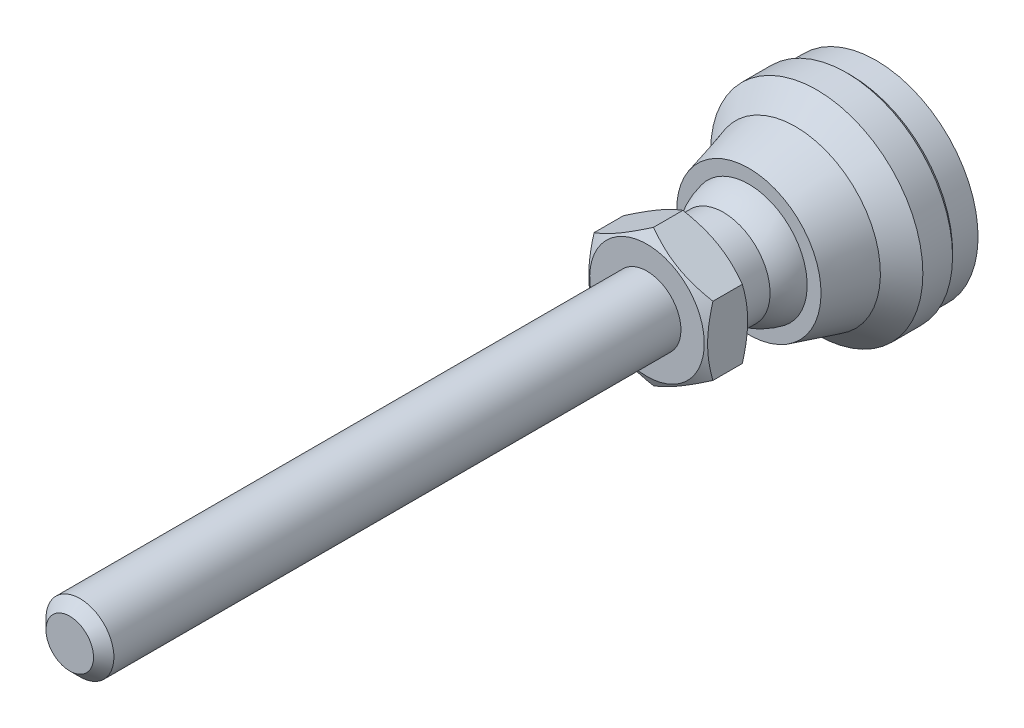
ISO-10303-21;
HEADER;
FILE_DESCRIPTION(('STEP AP214'),'2;1');
FILE_NAME('part.step','',(''),(''),'','','');
FILE_SCHEMA(('AUTOMOTIVE_DESIGN { 1 0 10303 214 1 1 1 1 }'));
ENDSEC;
DATA;
#1=APPLICATION_CONTEXT('core data for automotive mechanical design processes');
#2=APPLICATION_PROTOCOL_DEFINITION('international standard','automotive_design',2000,#1);
#3=PRODUCT_CONTEXT('',#1,'mechanical');
#4=PRODUCT('Part','Part','',(#3));
#5=PRODUCT_RELATED_PRODUCT_CATEGORY('part','',(#4));
#6=PRODUCT_DEFINITION_FORMATION('','',#4);
#7=PRODUCT_DEFINITION_CONTEXT('part definition',#1,'design');
#8=PRODUCT_DEFINITION('design','',#6,#7);
#9=PRODUCT_DEFINITION_SHAPE('','',#8);
#10=(LENGTH_UNIT() NAMED_UNIT(*) SI_UNIT(.MILLI.,.METRE.));
#11=(NAMED_UNIT(*) PLANE_ANGLE_UNIT() SI_UNIT($,.RADIAN.));
#12=(NAMED_UNIT(*) SI_UNIT($,.STERADIAN.) SOLID_ANGLE_UNIT());
#13=UNCERTAINTY_MEASURE_WITH_UNIT(LENGTH_MEASURE(1.E-05),#10,'distance_accuracy_value','');
#14=(GEOMETRIC_REPRESENTATION_CONTEXT(3) GLOBAL_UNCERTAINTY_ASSIGNED_CONTEXT((#13)) GLOBAL_UNIT_ASSIGNED_CONTEXT((#10,
#11,#12)) REPRESENTATION_CONTEXT('',''));
#15=CARTESIAN_POINT('',(0.,0.,0.));
#16=DIRECTION('',(0.,0.,1.));
#17=DIRECTION('',(1.,0.,0.));
#18=AXIS2_PLACEMENT_3D('',#15,#16,#17);
#19=CARTESIAN_POINT('',(-5.49999999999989,0.,22.));
#20=DIRECTION('',(0.,0.,1.));
#21=DIRECTION('',(0.,-1.,0.));
#22=AXIS2_PLACEMENT_3D('',#19,#20,#21);
#23=PLANE('',#22);
#24=CARTESIAN_POINT('',(0.,0.,22.));
#25=DIRECTION('',(0.,0.,1.));
#26=DIRECTION('',(0.,-1.,0.));
#27=AXIS2_PLACEMENT_3D('',#24,#25,#26);
#28=CIRCLE('',#27,6.75);
#29=CARTESIAN_POINT('',(0.,-6.75,22.));
#30=VERTEX_POINT('',#29);
#31=EDGE_CURVE('E440',#30,#30,#28,.T.);
#32=ORIENTED_EDGE('',*,*,#31,.F.);
#33=EDGE_LOOP('',(#32));
#34=FACE_BOUND('',#33,.T.);
#35=CARTESIAN_POINT('',(0.,0.,22.));
#36=DIRECTION('',(0.,0.,-1.));
#37=DIRECTION('',(0.,1.,0.));
#38=AXIS2_PLACEMENT_3D('',#35,#36,#37);
#39=CIRCLE('',#38,5.49999999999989);
#40=CARTESIAN_POINT('',(0.,5.49999999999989,22.));
#41=VERTEX_POINT('',#40);
#42=EDGE_CURVE('E120',#41,#41,#39,.T.);
#43=ORIENTED_EDGE('',*,*,#42,.F.);
#44=EDGE_LOOP('',(#43));
#45=FACE_BOUND('',#44,.T.);
#46=ADVANCED_FACE('F14',(#34,#45),#23,.F.);
#47=CARTESIAN_POINT('',(0.,0.,0.));
#48=DIRECTION('',(0.,0.,-1.));
#49=DIRECTION('',(0.,1.,0.));
#50=AXIS2_PLACEMENT_3D('',#47,#48,#49);
#51=CYLINDRICAL_SURFACE('',#50,5.49999999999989);
#52=CARTESIAN_POINT('',(0.,0.,18.));
#53=DIRECTION('',(0.,0.,-1.));
#54=DIRECTION('',(0.,1.,0.));
#55=AXIS2_PLACEMENT_3D('',#52,#53,#54);
#56=CIRCLE('',#55,5.49999999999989);
#57=CARTESIAN_POINT('',(-5.49999999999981,0.,18.));
#58=VERTEX_POINT('',#57);
#59=EDGE_CURVE('E117',#58,#58,#56,.T.);
#60=ORIENTED_EDGE('',*,*,#59,.F.);
#61=EDGE_LOOP('',(#60));
#62=FACE_BOUND('',#61,.T.);
#63=ORIENTED_EDGE('',*,*,#42,.T.);
#64=EDGE_LOOP('',(#63));
#65=FACE_BOUND('',#64,.T.);
#66=ADVANCED_FACE('F144',(#62,#65),#51,.T.);
#67=CARTESIAN_POINT('',(1.11022302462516E-13,0.,13.6698729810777));
#68=DIRECTION('',(0.,0.,-1.));
#69=DIRECTION('',(-1.,0.,0.));
#70=AXIS2_PLACEMENT_3D('',#67,#68,#69);
#71=SPHERICAL_SURFACE('',#70,7.);
#72=CARTESIAN_POINT('',(0.,0.,15.));
#73=DIRECTION('',(0.,0.,-1.));
#74=DIRECTION('',(0.,1.,0.));
#75=AXIS2_PLACEMENT_3D('',#72,#73,#74);
#76=CIRCLE('',#75,6.87246404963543);
#77=CARTESIAN_POINT('',(-6.87246404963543,0.,15.));
#78=VERTEX_POINT('',#77);
#79=EDGE_CURVE('E114',#78,#78,#76,.T.);
#80=CARTESIAN_POINT('',(-6.87246404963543,0.,15.));
#81=CARTESIAN_POINT('',(-6.86587210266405,0.,15.0340591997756));
#82=CARTESIAN_POINT('',(-6.8590269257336,0.,15.0680693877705));
#83=CARTESIAN_POINT('',(-6.84483171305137,0.,15.1359842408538));
#84=CARTESIAN_POINT('',(-6.83748167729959,0.,15.1698889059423));
#85=CARTESIAN_POINT('',(-6.8222783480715,0.,15.2375852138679));
#86=CARTESIAN_POINT('',(-6.81442505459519,0.,15.2713768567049));
#87=CARTESIAN_POINT('',(-6.7982169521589,0.,15.3388396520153));
#88=CARTESIAN_POINT('',(-6.78986214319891,0.,15.3725108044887));
#89=CARTESIAN_POINT('',(-6.77265285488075,0.,15.4397251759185));
#90=CARTESIAN_POINT('',(-6.76379837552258,0.,15.473268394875));
#91=CARTESIAN_POINT('',(-6.74559170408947,0.,15.5402194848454));
#92=CARTESIAN_POINT('',(-6.73623951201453,0.,15.5736273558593));
#93=CARTESIAN_POINT('',(-6.71703948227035,0.,15.6403003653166));
#94=CARTESIAN_POINT('',(-6.70719164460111,0.,15.67356550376));
#95=CARTESIAN_POINT('',(-6.68700250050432,0.,15.7399456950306));
#96=CARTESIAN_POINT('',(-6.67666119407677,0.,15.7730607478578));
#97=CARTESIAN_POINT('',(-6.65548739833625,0.,15.8391334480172));
#98=CARTESIAN_POINT('',(-6.64465490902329,0.,15.8720910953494));
#99=CARTESIAN_POINT('',(-6.62250114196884,0.,15.9378416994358));
#100=CARTESIAN_POINT('',(-6.61117986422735,0.,15.9706346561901));
#101=CARTESIAN_POINT('',(-6.58805102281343,0.,16.0360486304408));
#102=CARTESIAN_POINT('',(-6.576243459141,0.,16.0686696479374));
#103=CARTESIAN_POINT('',(-6.55214465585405,0.,16.1337325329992));
#104=CARTESIAN_POINT('',(-6.53985341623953,0.,16.1661744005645));
#105=CARTESIAN_POINT('',(-6.51478997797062,0.,16.2308718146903));
#106=CARTESIAN_POINT('',(-6.50201777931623,0.,16.2631273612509));
#107=CARTESIAN_POINT('',(-6.47599524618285,0.,16.3274450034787));
#108=CARTESIAN_POINT('',(-6.46274491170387,0.,16.3595070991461));
#109=CARTESIAN_POINT('',(-6.43576903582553,0.,16.4234307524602));
#110=CARTESIAN_POINT('',(-6.42204349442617,0.,16.455292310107));
#111=CARTESIAN_POINT('',(-6.39412023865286,0.,16.5188078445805));
#112=CARTESIAN_POINT('',(-6.3799225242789,0.,16.5504618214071));
#113=CARTESIAN_POINT('',(-6.35105806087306,0.,16.6135551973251));
#114=CARTESIAN_POINT('',(-6.33639131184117,0.,16.6449945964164));
#115=CARTESIAN_POINT('',(-6.30659202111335,0.,16.7076518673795));
#116=CARTESIAN_POINT('',(-6.29145947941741,0.,16.7388697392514));
#117=CARTESIAN_POINT('',(-6.26073194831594,0.,16.8010770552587));
#118=CARTESIAN_POINT('',(-6.2451369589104,0.,16.8320664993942));
#119=CARTESIAN_POINT('',(-6.21348797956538,0.,16.8938101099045));
#120=CARTESIAN_POINT('',(-6.1974339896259,0.,16.9245642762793));
#121=CARTESIAN_POINT('',(-6.16487055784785,0.,16.9858305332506));
#122=CARTESIAN_POINT('',(-6.14836111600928,0.,17.016342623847));
#123=CARTESIAN_POINT('',(-6.11489042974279,0.,17.0771179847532));
#124=CARTESIAN_POINT('',(-6.09792918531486,0.,17.107381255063));
#125=CARTESIAN_POINT('',(-6.06355864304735,0.,17.1676522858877));
#126=CARTESIAN_POINT('',(-6.04614934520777,0.,17.1976600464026));
#127=CARTESIAN_POINT('',(-6.01088654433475,0.,17.2574134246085));
#128=CARTESIAN_POINT('',(-5.9930330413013,0.,17.2871590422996));
#129=CARTESIAN_POINT('',(-5.95688577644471,0.,17.3463815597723));
#130=CARTESIAN_POINT('',(-5.93859201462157,0.,17.3758584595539));
#131=CARTESIAN_POINT('',(-5.90156827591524,0.,17.4345370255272));
#132=CARTESIAN_POINT('',(-5.88283829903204,0.,17.4637386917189));
#133=CARTESIAN_POINT('',(-5.84494627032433,0.,17.5218603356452));
#134=CARTESIAN_POINT('',(-5.82578421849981,0.,17.5507803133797));
#135=CARTESIAN_POINT('',(-5.78703227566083,0.,17.6083321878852));
#136=CARTESIAN_POINT('',(-5.76744238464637,0.,17.6369640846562));
#137=CARTESIAN_POINT('',(-5.72783909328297,0.,17.6939334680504));
#138=CARTESIAN_POINT('',(-5.70782569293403,0.,17.7222709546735));
#139=CARTESIAN_POINT('',(-5.66737980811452,0.,17.778645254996));
#140=CARTESIAN_POINT('',(-5.64694732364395,0.,17.8066820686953));
#141=CARTESIAN_POINT('',(-5.60566778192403,0.,17.862448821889));
#142=CARTESIAN_POINT('',(-5.58482072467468,0.,17.8901787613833));
#143=CARTESIAN_POINT('',(-5.54271666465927,0.,17.9453256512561));
#144=CARTESIAN_POINT('',(-5.5214596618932,0.,17.9727426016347));
#145=CARTESIAN_POINT('',(-5.49999999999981,0.,18.));
#146=B_SPLINE_CURVE_WITH_KNOTS('',3,(#80,#81,#82,#83,#84,#85,#86,#87,#88,#89,#90,#91,#92,#93,
#94,#95,#96,#97,#98,#99,#100,#101,#102,#103,#104,#105,#106,#107,#108,#109,#110,#111,#112,#113,
#114,#115,#116,#117,#118,#119,#120,#121,#122,#123,#124,#125,#126,#127,#128,#129,#130,#131,#132,
#133,#134,#135,#136,#137,#138,#139,#140,#141,#142,#143,#144,#145),.UNSPECIFIED.,.F.,.F.,(4,2,2,
2,2,2,2,2,2,2,2,2,2,2,2,2,2,2,2,2,2,2,2,2,2,2,2,2,2,2,2,2,4),(0.,0.104072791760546,
0.208145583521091,0.312218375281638,0.416291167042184,0.52036395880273,0.624436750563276,
0.728509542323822,0.832582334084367,0.936655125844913,1.04072791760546,1.144800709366,
1.24887350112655,1.3529462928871,1.45701908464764,1.56109187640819,1.66516466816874,
1.76923745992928,1.87331025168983,1.97738304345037,2.08145583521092,2.18552862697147,
2.28960141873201,2.39367421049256,2.4977470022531,2.60181979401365,2.7058925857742,
2.80996537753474,2.91403816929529,3.01811096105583,3.12218375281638,3.22625654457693,
3.33032933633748),.UNSPECIFIED.);
#147=EDGE_CURVE('BSEAM151',#78,#58,#146,.T.);
#148=ORIENTED_EDGE('',*,*,#79,.F.);
#149=ORIENTED_EDGE('',*,*,#59,.T.);
#150=ORIENTED_EDGE('',*,*,#147,.T.);
#151=ORIENTED_EDGE('',*,*,#147,.F.);
#152=EDGE_LOOP('',(#148,#150,#149,#151));
#153=FACE_BOUND('',#152,.T.);
#154=ADVANCED_FACE('F151',(#153),#71,.T.);
#155=CARTESIAN_POINT('',(-8.5,0.,15.));
#156=DIRECTION('',(0.,0.,-1.));
#157=DIRECTION('',(0.,1.,0.));
#158=AXIS2_PLACEMENT_3D('',#155,#156,#157);
#159=PLANE('',#158);
#160=CARTESIAN_POINT('',(0.,0.,15.));
#161=DIRECTION('',(0.,0.,-1.));
#162=DIRECTION('',(0.,1.,0.));
#163=AXIS2_PLACEMENT_3D('',#160,#161,#162);
#164=CIRCLE('',#163,8.5);
#165=CARTESIAN_POINT('',(0.,8.5,15.));
#166=VERTEX_POINT('',#165);
#167=EDGE_CURVE('E111',#166,#166,#164,.T.);
#168=ORIENTED_EDGE('',*,*,#167,.F.);
#169=EDGE_LOOP('',(#168));
#170=FACE_BOUND('',#169,.T.);
#171=ORIENTED_EDGE('',*,*,#79,.T.);
#172=EDGE_LOOP('',(#171));
#173=FACE_BOUND('',#172,.T.);
#174=ADVANCED_FACE('F303',(#170,#173),#159,.F.);
#175=CARTESIAN_POINT('',(0.,0.,15.));
#176=DIRECTION('',(0.,0.,-1.));
#177=DIRECTION('',(0.,1.,0.));
#178=AXIS2_PLACEMENT_3D('',#175,#176,#177);
#179=CONICAL_SURFACE('',#178,8.5,0.266252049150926);
#180=CARTESIAN_POINT('',(0.,0.,9.5));
#181=DIRECTION('',(0.,0.,-1.));
#182=DIRECTION('',(0.,1.,0.));
#183=AXIS2_PLACEMENT_3D('',#180,#181,#182);
#184=CIRCLE('',#183,10.);
#185=CARTESIAN_POINT('',(0.,10.,9.5));
#186=VERTEX_POINT('',#185);
#187=EDGE_CURVE('E108',#186,#186,#184,.T.);
#188=ORIENTED_EDGE('',*,*,#187,.F.);
#189=EDGE_LOOP('',(#188));
#190=FACE_BOUND('',#189,.T.);
#191=ORIENTED_EDGE('',*,*,#167,.T.);
#192=EDGE_LOOP('',(#191));
#193=FACE_BOUND('',#192,.T.);
#194=ADVANCED_FACE('F293',(#190,#193),#179,.T.);
#195=CARTESIAN_POINT('',(0.,0.,9.5));
#196=DIRECTION('',(0.,0.,-1.));
#197=DIRECTION('',(0.,1.,0.));
#198=AXIS2_PLACEMENT_3D('',#195,#196,#197);
#199=CONICAL_SURFACE('',#198,10.,0.785398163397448);
#200=CARTESIAN_POINT('',(0.,0.,6.99999999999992));
#201=DIRECTION('',(0.,0.,-1.));
#202=DIRECTION('',(0.,1.,0.));
#203=AXIS2_PLACEMENT_3D('',#200,#201,#202);
#204=CIRCLE('',#203,12.5);
#205=CARTESIAN_POINT('',(0.,12.5,6.99999999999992));
#206=VERTEX_POINT('',#205);
#207=EDGE_CURVE('E105',#206,#206,#204,.T.);
#208=ORIENTED_EDGE('',*,*,#207,.F.);
#209=EDGE_LOOP('',(#208));
#210=FACE_BOUND('',#209,.T.);
#211=ORIENTED_EDGE('',*,*,#187,.T.);
#212=EDGE_LOOP('',(#211));
#213=FACE_BOUND('',#212,.T.);
#214=ADVANCED_FACE('F283',(#210,#213),#199,.T.);
#215=CARTESIAN_POINT('',(0.,0.,0.));
#216=DIRECTION('',(0.,0.,-1.));
#217=DIRECTION('',(0.,1.,0.));
#218=AXIS2_PLACEMENT_3D('',#215,#216,#217);
#219=CYLINDRICAL_SURFACE('',#218,12.5);
#220=CARTESIAN_POINT('',(0.,0.,3.49999999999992));
#221=DIRECTION('',(0.,0.,-1.));
#222=DIRECTION('',(0.,1.,0.));
#223=AXIS2_PLACEMENT_3D('',#220,#221,#222);
#224=CIRCLE('',#223,12.5);
#225=CARTESIAN_POINT('',(0.,12.5,3.49999999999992));
#226=VERTEX_POINT('',#225);
#227=EDGE_CURVE('E102',#226,#226,#224,.T.);
#228=ORIENTED_EDGE('',*,*,#227,.F.);
#229=EDGE_LOOP('',(#228));
#230=FACE_BOUND('',#229,.T.);
#231=ORIENTED_EDGE('',*,*,#207,.T.);
#232=EDGE_LOOP('',(#231));
#233=FACE_BOUND('',#232,.T.);
#234=ADVANCED_FACE('F273',(#230,#233),#219,.T.);
#235=CARTESIAN_POINT('',(0.,0.,3.49999999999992));
#236=DIRECTION('',(0.,0.,1.));
#237=DIRECTION('',(0.,-1.,0.));
#238=AXIS2_PLACEMENT_3D('',#235,#236,#237);
#239=CONICAL_SURFACE('',#238,12.5,0.785398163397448);
#240=CARTESIAN_POINT('',(0.,0.,2.99999999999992));
#241=DIRECTION('',(0.,0.,-1.));
#242=DIRECTION('',(0.,1.,0.));
#243=AXIS2_PLACEMENT_3D('',#240,#241,#242);
#244=CIRCLE('',#243,12.);
#245=CARTESIAN_POINT('',(0.,12.,2.99999999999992));
#246=VERTEX_POINT('',#245);
#247=EDGE_CURVE('E99',#246,#246,#244,.T.);
#248=ORIENTED_EDGE('',*,*,#247,.F.);
#249=EDGE_LOOP('',(#248));
#250=FACE_BOUND('',#249,.T.);
#251=ORIENTED_EDGE('',*,*,#227,.T.);
#252=EDGE_LOOP('',(#251));
#253=FACE_BOUND('',#252,.T.);
#254=ADVANCED_FACE('F263',(#250,#253),#239,.T.);
#255=CARTESIAN_POINT('',(0.,0.,0.));
#256=DIRECTION('',(0.,0.,-1.));
#257=DIRECTION('',(0.,1.,0.));
#258=AXIS2_PLACEMENT_3D('',#255,#256,#257);
#259=CYLINDRICAL_SURFACE('',#258,12.);
#260=CARTESIAN_POINT('',(0.,0.,0.));
#261=DIRECTION('',(0.,0.,-1.));
#262=DIRECTION('',(0.,1.,0.));
#263=AXIS2_PLACEMENT_3D('',#260,#261,#262);
#264=CIRCLE('',#263,12.);
#265=CARTESIAN_POINT('',(0.,12.,0.));
#266=VERTEX_POINT('',#265);
#267=EDGE_CURVE('E96',#266,#266,#264,.T.);
#268=ORIENTED_EDGE('',*,*,#267,.F.);
#269=EDGE_LOOP('',(#268));
#270=FACE_BOUND('',#269,.T.);
#271=ORIENTED_EDGE('',*,*,#247,.T.);
#272=EDGE_LOOP('',(#271));
#273=FACE_BOUND('',#272,.T.);
#274=ADVANCED_FACE('F252',(#270,#273),#259,.T.);
#275=CARTESIAN_POINT('',(-12.,0.,0.));
#276=DIRECTION('',(0.,0.,1.));
#277=DIRECTION('',(0.,-1.,0.));
#278=AXIS2_PLACEMENT_3D('',#275,#276,#277);
#279=PLANE('',#278);
#280=ORIENTED_EDGE('',*,*,#267,.T.);
#281=EDGE_LOOP('',(#280));
#282=FACE_BOUND('',#281,.T.);
#283=ADVANCED_FACE('F142',(#282),#279,.F.);
#284=CARTESIAN_POINT('',(0.,0.,22.));
#285=DIRECTION('',(0.,0.,1.));
#286=DIRECTION('',(0.,-1.,0.));
#287=AXIS2_PLACEMENT_3D('',#284,#285,#286);
#288=CONICAL_SURFACE('',#287,6.75,1.0471975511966);
#289=CARTESIAN_POINT('',(0.000200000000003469,-8.08301923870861,22.7696190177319));
#290=CARTESIAN_POINT('',(-0.15366790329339,-7.99418356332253,22.7183374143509));
#291=CARTESIAN_POINT('',(-0.308109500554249,-7.9050166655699,22.669383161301));
#292=CARTESIAN_POINT('',(-0.618246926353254,-7.72595873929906,22.5767703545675));
#293=CARTESIAN_POINT('',(-0.773943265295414,-7.63606741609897,22.5331140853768));
#294=CARTESIAN_POINT('',(-1.24352516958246,-7.36495417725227,22.4109491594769));
#295=CARTESIAN_POINT('',(-1.5592643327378,-7.18266208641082,22.3414631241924));
#296=CARTESIAN_POINT('',(-2.03176224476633,-6.90986528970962,22.2599825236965));
#297=CARTESIAN_POINT('',(-2.18710922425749,-6.8201756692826,22.2367710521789));
#298=CARTESIAN_POINT('',(-2.49850511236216,-6.64039116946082,22.1978487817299));
#299=CARTESIAN_POINT('',(-2.65455395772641,-6.55029632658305,22.1821373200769));
#300=CARTESIAN_POINT('',(-2.96692267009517,-6.36995016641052,22.1586154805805));
#301=CARTESIAN_POINT('',(-3.12324202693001,-6.27969914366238,22.1507961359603));
#302=CARTESIAN_POINT('',(-3.43601650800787,-6.09911871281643,22.1432178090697));
#303=CARTESIAN_POINT('',(-3.59247162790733,-6.00878930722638,22.1434585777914));
#304=CARTESIAN_POINT('',(-4.02110687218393,-5.76131663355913,22.155197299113));
#305=CARTESIAN_POINT('',(-4.2931466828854,-5.60425437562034,22.1749033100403));
#306=CARTESIAN_POINT('',(-4.8354194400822,-5.29117305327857,22.2373910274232));
#307=CARTESIAN_POINT('',(-5.10565047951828,-5.13515508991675,22.2801940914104));
#308=CARTESIAN_POINT('',(-5.64901454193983,-4.8214437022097,22.3871892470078));
#309=CARTESIAN_POINT('',(-5.92207900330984,-4.66378986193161,22.4518346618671));
#310=CARTESIAN_POINT('',(-6.46413578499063,-4.35083323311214,22.5985536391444));
#311=CARTESIAN_POINT('',(-6.73313504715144,-4.19552643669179,22.680592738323));
#312=CARTESIAN_POINT('',(-7.0002,-4.04133641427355,22.7696190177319));
#313=B_SPLINE_CURVE_WITH_KNOTS('',3,(#289,#290,#291,#292,#293,#294,#295,#296,#297,#298,#299,
#300,#301,#302,#303,#304,#305,#306,#307,#308,#309,#310,#311,#312),.UNSPECIFIED.,.F.,.F.,(4,2,2,
2,2,2,2,2,2,2,2,4),(0.,0.554727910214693,1.10969417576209,2.2219327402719,2.76443041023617,
3.30688013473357,3.8487128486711,4.39052882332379,5.33376515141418,6.27787517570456,
7.2429241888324,8.20607866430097),.UNSPECIFIED.);
#314=CARTESIAN_POINT('',(0.,-8.08290376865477,22.7695523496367));
#315=VERTEX_POINT('',#314);
#316=CARTESIAN_POINT('',(-7.,-4.04145188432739,22.7695523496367));
#317=VERTEX_POINT('',#316);
#318=EDGE_CURVE('E73',#315,#317,#313,.T.);
#319=ORIENTED_EDGE('',*,*,#318,.T.);
#320=CARTESIAN_POINT('',(-7.,10.8258605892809,25.5459866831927));
#321=CARTESIAN_POINT('',(-7.,10.5203736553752,25.3979189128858));
#322=CARTESIAN_POINT('',(-7.,10.2141822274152,25.2512795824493));
#323=CARTESIAN_POINT('',(-7.,9.60001560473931,24.9616617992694));
#324=CARTESIAN_POINT('',(-7.,9.29204013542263,24.8186839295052));
#325=CARTESIAN_POINT('',(-7.,8.67232945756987,24.5364673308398));
#326=CARTESIAN_POINT('',(-7.,8.36058288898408,24.3972534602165));
#327=CARTESIAN_POINT('',(-7.,7.73459974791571,24.1245630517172));
#328=CARTESIAN_POINT('',(-7.,7.42036329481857,23.9910862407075));
#329=CARTESIAN_POINT('',(-7.,6.77887569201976,23.7272628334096));
#330=CARTESIAN_POINT('',(-7.,6.45152791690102,23.5971498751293));
#331=CARTESIAN_POINT('',(-7.,5.79299236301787,23.3468441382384));
#332=CARTESIAN_POINT('',(-7.,5.46180415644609,23.2266524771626));
#333=CARTESIAN_POINT('',(-7.,4.79568645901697,22.9993669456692));
#334=CARTESIAN_POINT('',(-7.,4.46076620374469,22.8922463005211));
#335=CARTESIAN_POINT('',(-7.,3.78613377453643,22.6945583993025));
#336=CARTESIAN_POINT('',(-7.,3.44642315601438,22.6039858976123));
#337=CARTESIAN_POINT('',(-7.,2.76383913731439,22.4442465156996));
#338=CARTESIAN_POINT('',(-7.,2.42099337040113,22.3749647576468));
#339=CARTESIAN_POINT('',(-7.,1.90362677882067,22.2900248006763));
#340=CARTESIAN_POINT('',(-7.,1.73064199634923,22.2648741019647));
#341=CARTESIAN_POINT('',(-7.,1.3838228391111,22.2213942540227));
#342=CARTESIAN_POINT('',(-7.,1.20998854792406,22.2030644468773));
#343=CARTESIAN_POINT('',(-7.,0.863961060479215,22.1738198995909));
#344=CARTESIAN_POINT('',(-7.,0.691775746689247,22.1628122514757));
#345=CARTESIAN_POINT('',(-7.,0.347094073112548,22.148086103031));
#346=CARTESIAN_POINT('',(-7.,0.174597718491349,22.1443674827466));
#347=CARTESIAN_POINT('',(-7.,-0.170398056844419,22.1443080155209));
#348=CARTESIAN_POINT('',(-7.,-0.342897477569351,22.1479672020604));
#349=CARTESIAN_POINT('',(-7.,-0.687589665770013,22.1625744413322));
#350=CARTESIAN_POINT('',(-7.,-0.859782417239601,22.1735228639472));
#351=CARTESIAN_POINT('',(-7.,-1.27452580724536,22.2084412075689));
#352=CARTESIAN_POINT('',(-7.,-1.51678713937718,22.2359202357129));
#353=CARTESIAN_POINT('',(-7.,-1.99948060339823,22.3038005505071));
#354=CARTESIAN_POINT('',(-7.,-2.23991247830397,22.3442036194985));
#355=CARTESIAN_POINT('',(-7.,-2.95820645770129,22.482653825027));
#356=CARTESIAN_POINT('',(-7.,-3.43279257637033,22.5979158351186));
#357=CARTESIAN_POINT('',(-7.,-4.14238774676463,22.7974002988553));
#358=CARTESIAN_POINT('',(-7.,-4.38108720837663,22.8692470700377));
#359=CARTESIAN_POINT('',(-7.,-4.85616702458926,23.0203056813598));
#360=CARTESIAN_POINT('',(-7.,-5.09254736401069,23.0995175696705));
#361=CARTESIAN_POINT('',(-7.,-5.56306519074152,23.2640435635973));
#362=CARTESIAN_POINT('',(-7.,-5.79720341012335,23.3493555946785));
#363=CARTESIAN_POINT('',(-7.,-6.26354647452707,23.5250877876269));
#364=CARTESIAN_POINT('',(-7.,-6.49575134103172,23.6155078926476));
#365=CARTESIAN_POINT('',(-7.,-7.03901223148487,23.832837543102));
#366=CARTESIAN_POINT('',(-7.,-7.3493698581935,23.961489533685));
#367=CARTESIAN_POINT('',(-7.,-7.96748753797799,24.2249067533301));
#368=CARTESIAN_POINT('',(-7.,-8.27524743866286,24.3596723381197));
#369=CARTESIAN_POINT('',(-7.,-8.88864128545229,24.6341022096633));
#370=CARTESIAN_POINT('',(-7.,-9.194274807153,24.7737674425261));
#371=CARTESIAN_POINT('',(-7.,-9.80371890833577,25.0570270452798));
#372=CARTESIAN_POINT('',(-7.,-10.1075294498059,25.2006214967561));
#373=CARTESIAN_POINT('',(-7.,-10.7139313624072,25.4911572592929));
#374=CARTESIAN_POINT('',(-7.,-11.0165211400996,25.6381018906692));
#375=CARTESIAN_POINT('',(-7.,-11.6204059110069,25.9346304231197));
#376=CARTESIAN_POINT('',(-7.,-11.9217008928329,26.0842143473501));
#377=CARTESIAN_POINT('',(-7.,-12.8238728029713,26.5361913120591));
#378=CARTESIAN_POINT('',(-7.,-13.4231148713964,26.8418473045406));
#379=CARTESIAN_POINT('',(-7.,-14.569065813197,27.4338034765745));
#380=CARTESIAN_POINT('',(-7.,-15.1160267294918,27.7196178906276));
#381=CARTESIAN_POINT('',(-7.,-16.2079126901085,28.2951512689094));
#382=CARTESIAN_POINT('',(-7.,-16.752837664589,28.5848703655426));
#383=CARTESIAN_POINT('',(-7.,-17.8397749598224,29.166579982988));
#384=CARTESIAN_POINT('',(-6.99999999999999,-18.3817911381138,29.4585633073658));
#385=CARTESIAN_POINT('',(-6.99999999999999,-19.4645191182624,30.0448703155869));
#386=CARTESIAN_POINT('',(-7.,-20.0052309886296,30.3391938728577));
#387=CARTESIAN_POINT('',(-7.,-20.5454614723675,30.6343924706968));
#388=B_SPLINE_CURVE_WITH_KNOTS('',3,(#320,#321,#322,#323,#324,#325,#326,#327,#328,#329,#330,
#331,#332,#333,#334,#335,#336,#337,#338,#339,#340,#341,#342,#343,#344,#345,#346,#347,#348,#349,
#350,#351,#352,#353,#354,#355,#356,#357,#358,#359,#360,#361,#362,#363,#364,#365,#366,#367,#368,
#369,#370,#371,#372,#373,#374,#375,#376,#377,#378,#379,#380,#381,#382,#383,#384,#385,#386,#387),
.UNSPECIFIED.,.F.,.F.,(4,2,2,2,2,2,2,2,2,2,2,2,2,2,2,2,2,2,2,2,2,2,2,2,2,2,2,2,2,2,2,2,2,4),(0.,
1.0184510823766,2.03706332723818,3.06127178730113,4.08543143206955,5.14208172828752,
6.19885088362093,7.25341765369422,8.30764955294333,9.35608902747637,9.88038644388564,
10.4046332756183,10.9220943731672,11.4395469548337,11.9570018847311,12.4744830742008,
13.2055137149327,13.9366452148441,15.399731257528,16.1475033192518,16.8952802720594,
17.6428041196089,18.3903196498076,19.39813001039,20.4059990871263,21.4140638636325,
22.4221495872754,23.4312820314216,24.4404233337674,26.458445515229,28.3098349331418,
30.1612872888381,32.0082576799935,33.8551288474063),.UNSPECIFIED.);
#389=CARTESIAN_POINT('',(-7.,4.04145188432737,22.7695523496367));
#390=VERTEX_POINT('',#389);
#391=EDGE_CURVE('E81',#317,#390,#388,.F.);
#392=ORIENTED_EDGE('',*,*,#391,.T.);
#393=CARTESIAN_POINT('',(-7.0002,4.04133641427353,22.7696190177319));
#394=CARTESIAN_POINT('',(-6.84633209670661,4.13017208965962,22.7183374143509));
#395=CARTESIAN_POINT('',(-6.69189049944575,4.21933898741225,22.669383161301));
#396=CARTESIAN_POINT('',(-6.38175307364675,4.39839691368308,22.5767703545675));
#397=CARTESIAN_POINT('',(-6.22605673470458,4.48828823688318,22.5331140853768));
#398=CARTESIAN_POINT('',(-5.75647483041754,4.75940147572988,22.4109491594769));
#399=CARTESIAN_POINT('',(-5.4407356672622,4.94169356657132,22.3414631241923));
#400=CARTESIAN_POINT('',(-4.96823775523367,5.21449036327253,22.2599825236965));
#401=CARTESIAN_POINT('',(-4.81289077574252,5.30417998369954,22.2367710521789));
#402=CARTESIAN_POINT('',(-4.50149488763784,5.48396448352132,22.1978487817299));
#403=CARTESIAN_POINT('',(-4.3454460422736,5.57405932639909,22.1821373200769));
#404=CARTESIAN_POINT('',(-4.03307732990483,5.75440548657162,22.1586154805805));
#405=CARTESIAN_POINT('',(-3.87675797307,5.84465650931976,22.1507961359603));
#406=CARTESIAN_POINT('',(-3.56398349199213,6.02523694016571,22.1432178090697));
#407=CARTESIAN_POINT('',(-3.40752837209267,6.11556634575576,22.1434585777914));
#408=CARTESIAN_POINT('',(-2.97889312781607,6.36303901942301,22.155197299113));
#409=CARTESIAN_POINT('',(-2.70685331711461,6.5201012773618,22.1749033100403));
#410=CARTESIAN_POINT('',(-2.16458055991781,6.83318259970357,22.2373910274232));
#411=CARTESIAN_POINT('',(-1.89434952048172,6.98920056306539,22.2801940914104));
#412=CARTESIAN_POINT('',(-1.35098545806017,7.30291195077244,22.3871892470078));
#413=CARTESIAN_POINT('',(-1.07792099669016,7.46056579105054,22.4518346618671));
#414=CARTESIAN_POINT('',(-0.53586421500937,7.77352241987,22.5985536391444));
#415=CARTESIAN_POINT('',(-0.266864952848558,7.92882921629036,22.680592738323));
#416=CARTESIAN_POINT('',(0.000200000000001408,8.08301923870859,22.7696190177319));
#417=B_SPLINE_CURVE_WITH_KNOTS('',3,(#393,#394,#395,#396,#397,#398,#399,#400,#401,#402,#403,
#404,#405,#406,#407,#408,#409,#410,#411,#412,#413,#414,#415,#416),.UNSPECIFIED.,.F.,.F.,(4,2,2,
2,2,2,2,2,2,2,2,4),(0.,0.554727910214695,1.10969417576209,2.22193274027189,2.76443041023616,
3.30688013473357,3.84871284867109,4.39052882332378,5.33376515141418,6.27787517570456,
7.2429241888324,8.20607866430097),.UNSPECIFIED.);
#418=CARTESIAN_POINT('',(0.,8.08290376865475,22.7695523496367));
#419=VERTEX_POINT('',#418);
#420=EDGE_CURVE('E395',#390,#419,#417,.T.);
#421=ORIENTED_EDGE('',*,*,#420,.T.);
#422=CARTESIAN_POINT('',(-0.000199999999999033,8.08301923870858,22.7696190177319));
#423=CARTESIAN_POINT('',(0.153667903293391,7.9941835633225,22.7183374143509));
#424=CARTESIAN_POINT('',(0.308109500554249,7.90501666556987,22.669383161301));
#425=CARTESIAN_POINT('',(0.618246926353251,7.72595873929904,22.5767703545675));
#426=CARTESIAN_POINT('',(0.773943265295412,7.63606741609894,22.5331140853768));
#427=CARTESIAN_POINT('',(1.24352516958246,7.36495417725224,22.4109491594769));
#428=CARTESIAN_POINT('',(1.55926433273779,7.1826620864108,22.3414631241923));
#429=CARTESIAN_POINT('',(2.03176224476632,6.90986528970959,22.2599825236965));
#430=CARTESIAN_POINT('',(2.18710922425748,6.82017566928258,22.2367710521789));
#431=CARTESIAN_POINT('',(2.49850511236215,6.6403911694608,22.1978487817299));
#432=CARTESIAN_POINT('',(2.6545539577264,6.55029632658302,22.1821373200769));
#433=CARTESIAN_POINT('',(2.96692267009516,6.3699501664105,22.1586154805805));
#434=CARTESIAN_POINT('',(3.12324202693,6.27969914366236,22.1507961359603));
#435=CARTESIAN_POINT('',(3.43601650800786,6.09911871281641,22.1432178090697));
#436=CARTESIAN_POINT('',(3.59247162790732,6.00878930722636,22.1434585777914));
#437=CARTESIAN_POINT('',(4.02110687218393,5.76131663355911,22.155197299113));
#438=CARTESIAN_POINT('',(4.29314668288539,5.60425437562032,22.1749033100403));
#439=CARTESIAN_POINT('',(4.83541944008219,5.29117305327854,22.2373910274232));
#440=CARTESIAN_POINT('',(5.10565047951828,5.13515508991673,22.2801940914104));
#441=CARTESIAN_POINT('',(5.64901454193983,4.82144370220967,22.3871892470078));
#442=CARTESIAN_POINT('',(5.92207900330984,4.66378986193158,22.4518346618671));
#443=CARTESIAN_POINT('',(6.46413578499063,4.35083323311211,22.5985536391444));
#444=CARTESIAN_POINT('',(6.73313504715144,4.19552643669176,22.680592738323));
#445=CARTESIAN_POINT('',(7.0002,4.04133641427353,22.7696190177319));
#446=B_SPLINE_CURVE_WITH_KNOTS('',3,(#422,#423,#424,#425,#426,#427,#428,#429,#430,#431,#432,
#433,#434,#435,#436,#437,#438,#439,#440,#441,#442,#443,#444,#445),.UNSPECIFIED.,.F.,.F.,(4,2,2,
2,2,2,2,2,2,2,2,4),(0.,0.554727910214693,1.10969417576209,2.22193274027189,2.76443041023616,
3.30688013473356,3.84871284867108,4.39052882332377,5.33376515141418,6.27787517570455,
7.2429241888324,8.20607866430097),.UNSPECIFIED.);
#447=CARTESIAN_POINT('',(7.,4.04145188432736,22.7695523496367));
#448=VERTEX_POINT('',#447);
#449=EDGE_CURVE('E390',#419,#448,#446,.T.);
#450=ORIENTED_EDGE('',*,*,#449,.T.);
#451=CARTESIAN_POINT('',(7.,10.825860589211,25.5459866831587));
#452=CARTESIAN_POINT('',(7.,10.5203736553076,25.3979189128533));
#453=CARTESIAN_POINT('',(7.,10.2141822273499,25.2512795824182));
#454=CARTESIAN_POINT('',(7.,9.60001560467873,24.9616617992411));
#455=CARTESIAN_POINT('',(7.,9.29204013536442,24.8186839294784));
#456=CARTESIAN_POINT('',(7.,8.67232945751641,24.5364673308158));
#457=CARTESIAN_POINT('',(7.,8.36058288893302,24.3972534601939));
#458=CARTESIAN_POINT('',(7.,7.73459974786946,24.1245630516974));
#459=CARTESIAN_POINT('',(7.,7.42036329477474,23.9910862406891));
#460=CARTESIAN_POINT('',(7.,6.77887569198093,23.727262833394));
#461=CARTESIAN_POINT('',(7.,6.45152791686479,23.5971498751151));
#462=CARTESIAN_POINT('',(7.,5.79299236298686,23.346844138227));
#463=CARTESIAN_POINT('',(7.,5.46180415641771,23.2266524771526));
#464=CARTESIAN_POINT('',(7.,4.79568645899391,22.9993669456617));
#465=CARTESIAN_POINT('',(7.,4.46076620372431,22.8922463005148));
#466=CARTESIAN_POINT('',(7.,3.78613377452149,22.6945583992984));
#467=CARTESIAN_POINT('',(7.,3.4464231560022,22.6039858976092));
#468=CARTESIAN_POINT('',(7.,2.76383913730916,22.4442465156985));
#469=CARTESIAN_POINT('',(7.,2.42099337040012,22.3749647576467));
#470=CARTESIAN_POINT('',(7.,1.90362677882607,22.2900248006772));
#471=CARTESIAN_POINT('',(7.,1.73064199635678,22.2648741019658));
#472=CARTESIAN_POINT('',(7.,1.38382283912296,22.2213942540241));
#473=CARTESIAN_POINT('',(7.,1.20998854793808,22.2030644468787));
#474=CARTESIAN_POINT('',(7.,0.863961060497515,22.1738198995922));
#475=CARTESIAN_POINT('',(7.,0.691775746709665,22.1628122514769));
#476=CARTESIAN_POINT('',(7.,0.347094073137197,22.1480861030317));
#477=CARTESIAN_POINT('',(7.,0.174597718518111,22.1443674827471));
#478=CARTESIAN_POINT('',(7.,-0.170398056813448,22.1443080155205));
#479=CARTESIAN_POINT('',(7.,-0.342897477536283,22.1479672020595));
#480=CARTESIAN_POINT('',(7.,-0.687589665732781,22.1625744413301));
#481=CARTESIAN_POINT('',(7.,-0.8597824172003,22.1735228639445));
#482=CARTESIAN_POINT('',(7.,-1.27452580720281,22.2084412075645));
#483=CARTESIAN_POINT('',(7.,-1.51678713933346,22.2359202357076));
#484=CARTESIAN_POINT('',(7.,-1.99948060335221,22.3038005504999));
#485=CARTESIAN_POINT('',(7.,-2.23991247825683,22.3442036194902));
#486=CARTESIAN_POINT('',(7.,-2.95820645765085,22.4826538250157));
#487=CARTESIAN_POINT('',(7.,-3.43279257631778,22.5979158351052));
#488=CARTESIAN_POINT('',(7.,-4.14238774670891,22.7974002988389));
#489=CARTESIAN_POINT('',(7.,-4.38108720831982,22.8692470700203));
#490=CARTESIAN_POINT('',(7.,-4.85616702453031,23.0203056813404));
#491=CARTESIAN_POINT('',(7.,-5.09254736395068,23.0995175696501));
#492=CARTESIAN_POINT('',(7.,-5.56306519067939,23.264043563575));
#493=CARTESIAN_POINT('',(7.,-5.79720341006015,23.3493555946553));
#494=CARTESIAN_POINT('',(7.,-6.26354647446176,23.5250877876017));
#495=CARTESIAN_POINT('',(7.,-6.49575134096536,23.6155078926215));
#496=CARTESIAN_POINT('',(7.,-7.03901223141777,23.8328375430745));
#497=CARTESIAN_POINT('',(7.,-7.34936985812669,23.961489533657));
#498=CARTESIAN_POINT('',(7.,-7.96748753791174,24.2249067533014));
#499=CARTESIAN_POINT('',(7.,-8.27524743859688,24.3596723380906));
#500=CARTESIAN_POINT('',(7.,-8.88864128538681,24.6341022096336));
#501=CARTESIAN_POINT('',(7.,-9.19427480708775,24.7737674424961));
#502=CARTESIAN_POINT('',(7.,-9.80371890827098,25.0570270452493));
#503=CARTESIAN_POINT('',(7.,-10.1075294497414,25.2006214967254));
#504=CARTESIAN_POINT('',(7.,-10.713931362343,25.4911572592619));
#505=CARTESIAN_POINT('',(7.,-11.0165211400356,25.638101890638));
#506=CARTESIAN_POINT('',(7.,-11.6204059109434,25.9346304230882));
#507=CARTESIAN_POINT('',(7.,-11.9217008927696,26.0842143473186));
#508=CARTESIAN_POINT('',(7.,-12.8238728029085,26.5361913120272));
#509=CARTESIAN_POINT('',(7.,-13.4231148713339,26.8418473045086));
#510=CARTESIAN_POINT('',(7.,-14.5690658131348,27.4338034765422));
#511=CARTESIAN_POINT('',(7.,-15.1160267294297,27.719617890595));
#512=CARTESIAN_POINT('',(7.,-16.2079126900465,28.2951512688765));
#513=CARTESIAN_POINT('',(7.,-16.752837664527,28.5848703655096));
#514=CARTESIAN_POINT('',(7.,-17.8397749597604,29.1665799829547));
#515=CARTESIAN_POINT('',(7.,-18.3817911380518,29.4585633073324));
#516=CARTESIAN_POINT('',(7.,-19.4645191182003,30.0448703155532));
#517=CARTESIAN_POINT('',(7.,-20.0052309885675,30.3391938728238));
#518=CARTESIAN_POINT('',(7.,-20.5454614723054,30.6343924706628));
#519=B_SPLINE_CURVE_WITH_KNOTS('',3,(#451,#452,#453,#454,#455,#456,#457,#458,#459,#460,#461,
#462,#463,#464,#465,#466,#467,#468,#469,#470,#471,#472,#473,#474,#475,#476,#477,#478,#479,#480,
#481,#482,#483,#484,#485,#486,#487,#488,#489,#490,#491,#492,#493,#494,#495,#496,#497,#498,#499,
#500,#501,#502,#503,#504,#505,#506,#507,#508,#509,#510,#511,#512,#513,#514,#515,#516,#517,#518),
.UNSPECIFIED.,.F.,.F.,(4,2,2,2,2,2,2,2,2,2,2,2,2,2,2,2,2,2,2,2,2,2,2,2,2,2,2,2,2,2,2,2,2,4),(0.,
1.01845108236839,2.03706332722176,3.06127178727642,4.08543143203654,5.14208172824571,
6.19885088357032,7.25341765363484,8.30764955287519,9.35608902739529,9.8803864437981,
10.4046332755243,10.9220943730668,11.439546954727,11.9570018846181,12.4744830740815,
13.2055137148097,13.9366452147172,15.3997312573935,16.1475033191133,16.895280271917,
17.6428041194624,18.3903196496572,19.39813001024,20.4059990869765,21.414063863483,
22.4221495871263,23.4312820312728,24.440423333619,26.4584455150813,28.3098349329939,
30.1612872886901,32.0082576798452,33.8551288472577),.UNSPECIFIED.);
#520=CARTESIAN_POINT('',(7.,-4.04145188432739,22.7695523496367));
#521=VERTEX_POINT('',#520);
#522=EDGE_CURVE('E34',#448,#521,#519,.T.);
#523=ORIENTED_EDGE('',*,*,#522,.T.);
#524=CARTESIAN_POINT('',(7.0002,-4.04133641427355,22.7696190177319));
#525=CARTESIAN_POINT('',(6.84633209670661,-4.13017208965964,22.7183374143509));
#526=CARTESIAN_POINT('',(6.69189049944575,-4.21933898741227,22.669383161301));
#527=CARTESIAN_POINT('',(6.38175307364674,-4.3983969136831,22.5767703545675));
#528=CARTESIAN_POINT('',(6.22605673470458,-4.4882882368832,22.5331140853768));
#529=CARTESIAN_POINT('',(5.75647483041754,-4.7594014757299,22.4109491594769));
#530=CARTESIAN_POINT('',(5.4407356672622,-4.94169356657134,22.3414631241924));
#531=CARTESIAN_POINT('',(4.96823775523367,-5.21449036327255,22.2599825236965));
#532=CARTESIAN_POINT('',(4.81289077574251,-5.30417998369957,22.2367710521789));
#533=CARTESIAN_POINT('',(4.50149488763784,-5.48396448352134,22.1978487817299));
#534=CARTESIAN_POINT('',(4.34544604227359,-5.57405932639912,22.1821373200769));
#535=CARTESIAN_POINT('',(4.03307732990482,-5.75440548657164,22.1586154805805));
#536=CARTESIAN_POINT('',(3.87675797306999,-5.84465650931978,22.1507961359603));
#537=CARTESIAN_POINT('',(3.56398349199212,-6.02523694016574,22.1432178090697));
#538=CARTESIAN_POINT('',(3.40752837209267,-6.11556634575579,22.1434585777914));
#539=CARTESIAN_POINT('',(2.97889312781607,-6.36303901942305,22.155197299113));
#540=CARTESIAN_POINT('',(2.7068533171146,-6.52010127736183,22.1749033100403));
#541=CARTESIAN_POINT('',(2.1645805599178,-6.83318259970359,22.2373910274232));
#542=CARTESIAN_POINT('',(1.89434952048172,-6.98920056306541,22.2801940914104));
#543=CARTESIAN_POINT('',(1.35098545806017,-7.30291195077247,22.3871892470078));
#544=CARTESIAN_POINT('',(1.07792099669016,-7.46056579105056,22.4518346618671));
#545=CARTESIAN_POINT('',(0.535864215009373,-7.77352241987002,22.5985536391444));
#546=CARTESIAN_POINT('',(0.266864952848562,-7.92882921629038,22.680592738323));
#547=CARTESIAN_POINT('',(-0.000199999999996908,-8.08301923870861,22.7696190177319));
#548=B_SPLINE_CURVE_WITH_KNOTS('',3,(#524,#525,#526,#527,#528,#529,#530,#531,#532,#533,#534,
#535,#536,#537,#538,#539,#540,#541,#542,#543,#544,#545,#546,#547),.UNSPECIFIED.,.F.,.F.,(4,2,2,
2,2,2,2,2,2,2,2,4),(0.,0.554727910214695,1.10969417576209,2.2219327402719,2.76443041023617,
3.30688013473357,3.8487128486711,4.39052882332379,5.33376515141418,6.27787517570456,
7.2429241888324,8.20607866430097),.UNSPECIFIED.);
#549=EDGE_CURVE('E9',#521,#315,#548,.T.);
#550=ORIENTED_EDGE('',*,*,#549,.T.);
#551=EDGE_LOOP('',(#319,#392,#421,#450,#523,#550));
#552=FACE_BOUND('',#551,.T.);
#553=ORIENTED_EDGE('',*,*,#31,.T.);
#554=EDGE_LOOP('',(#553));
#555=FACE_BOUND('',#554,.T.);
#556=ADVANCED_FACE('F71',(#552,#555),#288,.T.);
#557=CARTESIAN_POINT('',(-2.8,0.,95.));
#558=DIRECTION('',(0.,0.,-1.));
#559=DIRECTION('',(0.,1.,0.));
#560=AXIS2_PLACEMENT_3D('',#557,#558,#559);
#561=PLANE('',#560);
#562=CARTESIAN_POINT('',(0.,0.,95.));
#563=DIRECTION('',(0.,0.,-1.));
#564=DIRECTION('',(0.,1.,0.));
#565=AXIS2_PLACEMENT_3D('',#562,#563,#564);
#566=CIRCLE('',#565,2.8);
#567=CARTESIAN_POINT('',(0.,2.8,95.));
#568=VERTEX_POINT('',#567);
#569=EDGE_CURVE('E28',#568,#568,#566,.T.);
#570=ORIENTED_EDGE('',*,*,#569,.F.);
#571=EDGE_LOOP('',(#570));
#572=FACE_BOUND('',#571,.T.);
#573=ADVANCED_FACE('F16',(#572),#561,.F.);
#574=CARTESIAN_POINT('',(0.,0.,95.));
#575=DIRECTION('',(0.,0.,-1.));
#576=DIRECTION('',(0.,1.,0.));
#577=AXIS2_PLACEMENT_3D('',#574,#575,#576);
#578=CONICAL_SURFACE('',#577,2.8,0.785398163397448);
#579=CARTESIAN_POINT('',(0.,0.,93.8));
#580=DIRECTION('',(0.,0.,-1.));
#581=DIRECTION('',(0.,1.,0.));
#582=AXIS2_PLACEMENT_3D('',#579,#580,#581);
#583=CIRCLE('',#582,4.);
#584=CARTESIAN_POINT('',(0.,4.,93.8));
#585=VERTEX_POINT('',#584);
#586=EDGE_CURVE('E126',#585,#585,#583,.T.);
#587=ORIENTED_EDGE('',*,*,#586,.F.);
#588=EDGE_LOOP('',(#587));
#589=FACE_BOUND('',#588,.T.);
#590=ORIENTED_EDGE('',*,*,#569,.T.);
#591=EDGE_LOOP('',(#590));
#592=FACE_BOUND('',#591,.T.);
#593=ADVANCED_FACE('F131',(#589,#592),#578,.T.);
#594=CARTESIAN_POINT('',(0.,0.,0.));
#595=DIRECTION('',(0.,0.,-1.));
#596=DIRECTION('',(0.,1.,0.));
#597=AXIS2_PLACEMENT_3D('',#594,#595,#596);
#598=CYLINDRICAL_SURFACE('',#597,4.);
#599=CARTESIAN_POINT('',(0.,0.,27.));
#600=DIRECTION('',(0.,0.,-1.));
#601=DIRECTION('',(0.,1.,0.));
#602=AXIS2_PLACEMENT_3D('',#599,#600,#601);
#603=CIRCLE('',#602,4.);
#604=CARTESIAN_POINT('',(0.,4.,27.));
#605=VERTEX_POINT('',#604);
#606=EDGE_CURVE('E123',#605,#605,#603,.T.);
#607=ORIENTED_EDGE('',*,*,#606,.F.);
#608=EDGE_LOOP('',(#607));
#609=FACE_BOUND('',#608,.T.);
#610=ORIENTED_EDGE('',*,*,#586,.T.);
#611=EDGE_LOOP('',(#610));
#612=FACE_BOUND('',#611,.T.);
#613=ADVANCED_FACE('F140',(#609,#612),#598,.T.);
#614=CARTESIAN_POINT('',(-4.,0.,27.));
#615=DIRECTION('',(0.,0.,-1.));
#616=DIRECTION('',(0.,1.,0.));
#617=AXIS2_PLACEMENT_3D('',#614,#615,#616);
#618=PLANE('',#617);
#619=CARTESIAN_POINT('',(0.,0.,27.));
#620=DIRECTION('',(0.,0.,1.));
#621=DIRECTION('',(0.,-1.,0.));
#622=AXIS2_PLACEMENT_3D('',#619,#620,#621);
#623=CIRCLE('',#622,6.75);
#624=CARTESIAN_POINT('',(0.,-6.75,27.));
#625=VERTEX_POINT('',#624);
#626=EDGE_CURVE('E80',#625,#625,#623,.T.);
#627=ORIENTED_EDGE('',*,*,#626,.T.);
#628=EDGE_LOOP('',(#627));
#629=FACE_BOUND('',#628,.T.);
#630=ORIENTED_EDGE('',*,*,#606,.T.);
#631=EDGE_LOOP('',(#630));
#632=FACE_BOUND('',#631,.T.);
#633=ADVANCED_FACE('F158',(#629,#632),#618,.F.);
#634=CARTESIAN_POINT('',(0.,0.,25.3149287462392));
#635=DIRECTION('',(0.,0.,-1.));
#636=DIRECTION('',(0.,1.,0.));
#637=AXIS2_PLACEMENT_3D('',#634,#635,#636);
#638=CONICAL_SURFACE('',#637,9.66862902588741,1.0471975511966);
#639=CARTESIAN_POINT('',(-7.0002,-4.04133641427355,26.2303809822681));
#640=CARTESIAN_POINT('',(-6.84633209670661,-4.13017208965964,26.2816625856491));
#641=CARTESIAN_POINT('',(-6.69189049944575,-4.21933898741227,26.330616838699));
#642=CARTESIAN_POINT('',(-6.38175307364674,-4.39839691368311,26.4232296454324));
#643=CARTESIAN_POINT('',(-6.22605673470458,-4.4882882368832,26.4668859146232));
#644=CARTESIAN_POINT('',(-5.75647483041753,-4.75940147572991,26.5890508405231));
#645=CARTESIAN_POINT('',(-5.4407356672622,-4.94169356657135,26.6585368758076));
#646=CARTESIAN_POINT('',(-4.96823775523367,-5.21449036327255,26.7400174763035));
#647=CARTESIAN_POINT('',(-4.81289077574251,-5.30417998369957,26.7632289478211));
#648=CARTESIAN_POINT('',(-4.50149488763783,-5.48396448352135,26.8021512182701));
#649=CARTESIAN_POINT('',(-4.34544604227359,-5.57405932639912,26.8178626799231));
#650=CARTESIAN_POINT('',(-4.03307732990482,-5.75440548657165,26.8413845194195));
#651=CARTESIAN_POINT('',(-3.87675797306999,-5.84465650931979,26.8492038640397));
#652=CARTESIAN_POINT('',(-3.56398349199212,-6.02523694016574,26.8567821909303));
#653=CARTESIAN_POINT('',(-3.40752837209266,-6.11556634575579,26.8565414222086));
#654=CARTESIAN_POINT('',(-2.97889312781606,-6.36303901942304,26.844802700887));
#655=CARTESIAN_POINT('',(-2.7068533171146,-6.52010127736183,26.8250966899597));
#656=CARTESIAN_POINT('',(-2.1645805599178,-6.8331825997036,26.7626089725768));
#657=CARTESIAN_POINT('',(-1.89434952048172,-6.98920056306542,26.7198059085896));
#658=CARTESIAN_POINT('',(-1.35098545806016,-7.30291195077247,26.6128107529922));
#659=CARTESIAN_POINT('',(-1.07792099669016,-7.46056579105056,26.5481653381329));
#660=CARTESIAN_POINT('',(-0.535864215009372,-7.77352241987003,26.4014463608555));
#661=CARTESIAN_POINT('',(-0.26686495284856,-7.92882921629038,26.319407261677));
#662=CARTESIAN_POINT('',(0.000200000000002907,-8.08301923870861,26.2303809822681));
#663=B_SPLINE_CURVE_WITH_KNOTS('',3,(#639,#640,#641,#642,#643,#644,#645,#646,#647,#648,#649,
#650,#651,#652,#653,#654,#655,#656,#657,#658,#659,#660,#661,#662),.UNSPECIFIED.,.F.,.F.,(4,2,2,
2,2,2,2,2,2,2,2,4),(0.,0.554727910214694,1.10969417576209,2.2219327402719,2.76443041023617,
3.30688013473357,3.8487128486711,4.39052882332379,5.33376515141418,6.27787517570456,
7.2429241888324,8.20607866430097),.UNSPECIFIED.);
#664=CARTESIAN_POINT('',(-7.,-4.04145188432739,26.2304476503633));
#665=VERTEX_POINT('',#664);
#666=CARTESIAN_POINT('',(0.,-8.08290376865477,26.2304476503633));
#667=VERTEX_POINT('',#666);
#668=EDGE_CURVE('E88',#665,#667,#663,.T.);
#669=ORIENTED_EDGE('',*,*,#668,.T.);
#670=CARTESIAN_POINT('',(-0.000199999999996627,-8.08301923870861,26.2303809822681));
#671=CARTESIAN_POINT('',(0.153667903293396,-7.99418356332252,26.2816625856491));
#672=CARTESIAN_POINT('',(0.308109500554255,-7.90501666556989,26.330616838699));
#673=CARTESIAN_POINT('',(0.618246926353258,-7.72595873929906,26.4232296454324));
#674=CARTESIAN_POINT('',(0.773943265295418,-7.63606741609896,26.4668859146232));
#675=CARTESIAN_POINT('',(1.24352516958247,-7.36495417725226,26.5890508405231));
#676=CARTESIAN_POINT('',(1.5592643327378,-7.18266208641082,26.6585368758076));
#677=CARTESIAN_POINT('',(2.03176224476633,-6.90986528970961,26.7400174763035));
#678=CARTESIAN_POINT('',(2.18710922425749,-6.8201756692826,26.7632289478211));
#679=CARTESIAN_POINT('',(2.49850511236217,-6.64039116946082,26.8021512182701));
#680=CARTESIAN_POINT('',(2.65455395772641,-6.55029632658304,26.8178626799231));
#681=CARTESIAN_POINT('',(2.96692267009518,-6.36995016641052,26.8413845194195));
#682=CARTESIAN_POINT('',(3.12324202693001,-6.27969914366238,26.8492038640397));
#683=CARTESIAN_POINT('',(3.43601650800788,-6.09911871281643,26.8567821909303));
#684=CARTESIAN_POINT('',(3.59247162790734,-6.00878930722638,26.8565414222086));
#685=CARTESIAN_POINT('',(4.02110687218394,-5.76131663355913,26.844802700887));
#686=CARTESIAN_POINT('',(4.2931466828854,-5.60425437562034,26.8250966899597));
#687=CARTESIAN_POINT('',(4.8354194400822,-5.29117305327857,26.7626089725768));
#688=CARTESIAN_POINT('',(5.10565047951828,-5.13515508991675,26.7198059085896));
#689=CARTESIAN_POINT('',(5.64901454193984,-4.8214437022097,26.6128107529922));
#690=CARTESIAN_POINT('',(5.92207900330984,-4.66378986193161,26.5481653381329));
#691=CARTESIAN_POINT('',(6.46413578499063,-4.35083323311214,26.4014463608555));
#692=CARTESIAN_POINT('',(6.73313504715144,-4.19552643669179,26.319407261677));
#693=CARTESIAN_POINT('',(7.0002,-4.04133641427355,26.2303809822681));
#694=B_SPLINE_CURVE_WITH_KNOTS('',3,(#670,#671,#672,#673,#674,#675,#676,#677,#678,#679,#680,
#681,#682,#683,#684,#685,#686,#687,#688,#689,#690,#691,#692,#693),.UNSPECIFIED.,.F.,.F.,(4,2,2,
2,2,2,2,2,2,2,2,4),(0.,0.554727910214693,1.10969417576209,2.2219327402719,2.76443041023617,
3.30688013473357,3.84871284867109,4.39052882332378,5.33376515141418,6.27787517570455,
7.24292418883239,8.20607866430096),.UNSPECIFIED.);
#695=CARTESIAN_POINT('',(7.,-4.04145188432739,26.2304476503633));
#696=VERTEX_POINT('',#695);
#697=EDGE_CURVE('E86',#667,#696,#694,.T.);
#698=ORIENTED_EDGE('',*,*,#697,.T.);
#699=CARTESIAN_POINT('',(7.,10.825860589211,23.4540133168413));
#700=CARTESIAN_POINT('',(7.,10.5203736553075,23.6020810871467));
#701=CARTESIAN_POINT('',(7.,10.2141822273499,23.7487204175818));
#702=CARTESIAN_POINT('',(7.,9.60001560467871,24.0383382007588));
#703=CARTESIAN_POINT('',(7.,9.29204013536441,24.1813160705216));
#704=CARTESIAN_POINT('',(7.,8.6723294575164,24.4635326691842));
#705=CARTESIAN_POINT('',(7.,8.36058288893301,24.602746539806));
#706=CARTESIAN_POINT('',(7.,7.73459974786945,24.8754369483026));
#707=CARTESIAN_POINT('',(7.,7.42036329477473,25.0089137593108));
#708=CARTESIAN_POINT('',(7.,6.77887569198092,25.2727371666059));
#709=CARTESIAN_POINT('',(7.,6.45152791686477,25.4028501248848));
#710=CARTESIAN_POINT('',(7.,5.79299236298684,25.6531558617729));
#711=CARTESIAN_POINT('',(7.,5.4618041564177,25.7733475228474));
#712=CARTESIAN_POINT('',(7.,4.79568645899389,26.0006330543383));
#713=CARTESIAN_POINT('',(7.,4.4607662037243,26.1077536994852));
#714=CARTESIAN_POINT('',(7.,3.78613377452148,26.3054416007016));
#715=CARTESIAN_POINT('',(7.,3.44642315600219,26.3960141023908));
#716=CARTESIAN_POINT('',(7.,2.76383913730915,26.5557534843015));
#717=CARTESIAN_POINT('',(7.,2.42099337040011,26.6250352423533));
#718=CARTESIAN_POINT('',(7.,1.90362677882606,26.7099751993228));
#719=CARTESIAN_POINT('',(7.,1.73064199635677,26.7351258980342));
#720=CARTESIAN_POINT('',(7.,1.38382283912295,26.7786057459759));
#721=CARTESIAN_POINT('',(7.,1.20998854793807,26.7969355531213));
#722=CARTESIAN_POINT('',(7.,0.863961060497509,26.8261801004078));
#723=CARTESIAN_POINT('',(7.,0.69177574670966,26.8371877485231));
#724=CARTESIAN_POINT('',(7.,0.347094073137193,26.8519138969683));
#725=CARTESIAN_POINT('',(7.,0.174597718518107,26.8556325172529));
#726=CARTESIAN_POINT('',(7.,-0.170398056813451,26.8556919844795));
#727=CARTESIAN_POINT('',(7.,-0.342897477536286,26.8520327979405));
#728=CARTESIAN_POINT('',(7.,-0.687589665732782,26.8374255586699));
#729=CARTESIAN_POINT('',(7.,-0.859782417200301,26.8264771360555));
#730=CARTESIAN_POINT('',(7.,-1.27452580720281,26.7915587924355));
#731=CARTESIAN_POINT('',(7.,-1.51678713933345,26.7640797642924));
#732=CARTESIAN_POINT('',(7.,-1.9994806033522,26.6961994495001));
#733=CARTESIAN_POINT('',(7.,-2.23991247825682,26.6557963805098));
#734=CARTESIAN_POINT('',(7.,-2.95820645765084,26.5173461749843));
#735=CARTESIAN_POINT('',(7.,-3.43279257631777,26.4020841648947));
#736=CARTESIAN_POINT('',(7.,-4.14238774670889,26.2025997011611));
#737=CARTESIAN_POINT('',(7.,-4.38108720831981,26.1307529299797));
#738=CARTESIAN_POINT('',(7.,-4.8561670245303,25.9796943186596));
#739=CARTESIAN_POINT('',(7.,-5.09254736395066,25.9004824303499));
#740=CARTESIAN_POINT('',(7.,-5.56306519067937,25.735956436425));
#741=CARTESIAN_POINT('',(7.,-5.79720341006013,25.6506444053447));
#742=CARTESIAN_POINT('',(7.,-6.26354647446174,25.4749122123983));
#743=CARTESIAN_POINT('',(7.,-6.49575134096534,25.3844921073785));
#744=CARTESIAN_POINT('',(7.,-7.03901223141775,25.1671624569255));
#745=CARTESIAN_POINT('',(7.,-7.34936985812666,25.038510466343));
#746=CARTESIAN_POINT('',(7.,-7.96748753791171,24.7750932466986));
#747=CARTESIAN_POINT('',(7.,-8.27524743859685,24.6403276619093));
#748=CARTESIAN_POINT('',(7.,-8.88864128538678,24.3658977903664));
#749=CARTESIAN_POINT('',(7.,-9.19427480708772,24.2262325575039));
#750=CARTESIAN_POINT('',(7.,-9.80371890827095,23.9429729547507));
#751=CARTESIAN_POINT('',(7.,-10.1075294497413,23.7993785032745));
#752=CARTESIAN_POINT('',(7.,-10.713931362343,23.5088427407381));
#753=CARTESIAN_POINT('',(7.,-11.0165211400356,23.3618981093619));
#754=CARTESIAN_POINT('',(7.,-11.6204059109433,23.0653695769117));
#755=CARTESIAN_POINT('',(7.,-11.9217008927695,22.9157856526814));
#756=CARTESIAN_POINT('',(7.,-12.8238728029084,22.4638086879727));
#757=CARTESIAN_POINT('',(7.,-13.4231148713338,22.1581526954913));
#758=CARTESIAN_POINT('',(7.,-14.5690658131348,21.5661965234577));
#759=CARTESIAN_POINT('',(7.,-15.1160267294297,21.2803821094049));
#760=CARTESIAN_POINT('',(7.,-16.2079126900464,20.7048487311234));
#761=CARTESIAN_POINT('',(7.,-16.752837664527,20.4151296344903));
#762=CARTESIAN_POINT('',(7.,-17.8397749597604,19.8334200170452));
#763=CARTESIAN_POINT('',(7.,-18.3817911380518,19.5414366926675));
#764=CARTESIAN_POINT('',(7.,-19.4645191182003,18.9551296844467));
#765=CARTESIAN_POINT('',(7.,-20.0052309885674,18.6608061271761));
#766=CARTESIAN_POINT('',(7.,-20.5454614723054,18.3656075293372));
#767=B_SPLINE_CURVE_WITH_KNOTS('',3,(#699,#700,#701,#702,#703,#704,#705,#706,#707,#708,#709,
#710,#711,#712,#713,#714,#715,#716,#717,#718,#719,#720,#721,#722,#723,#724,#725,#726,#727,#728,
#729,#730,#731,#732,#733,#734,#735,#736,#737,#738,#739,#740,#741,#742,#743,#744,#745,#746,#747,
#748,#749,#750,#751,#752,#753,#754,#755,#756,#757,#758,#759,#760,#761,#762,#763,#764,#765,#766),
.UNSPECIFIED.,.F.,.F.,(4,2,2,2,2,2,2,2,2,2,2,2,2,2,2,2,2,2,2,2,2,2,2,2,2,2,2,2,2,2,2,2,2,4),(0.,
1.01845108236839,2.03706332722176,3.06127178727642,4.08543143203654,5.14208172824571,
6.19885088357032,7.25341765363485,8.30764955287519,9.35608902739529,9.8803864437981,
10.4046332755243,10.9220943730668,11.439546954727,11.9570018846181,12.4744830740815,
13.2055137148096,13.9366452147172,15.3997312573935,16.1475033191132,16.895280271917,
17.6428041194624,18.3903196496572,19.3981300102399,20.4059990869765,21.414063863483,
22.4221495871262,23.4312820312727,24.440423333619,26.4584455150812,28.3098349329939,
30.16128728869,32.0082576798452,33.8551288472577),.UNSPECIFIED.);
#768=CARTESIAN_POINT('',(7.,4.04145188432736,26.2304476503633));
#769=VERTEX_POINT('',#768);
#770=EDGE_CURVE('E435',#696,#769,#767,.F.);
#771=ORIENTED_EDGE('',*,*,#770,.T.);
#772=CARTESIAN_POINT('',(7.0002,4.04133641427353,26.2303809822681));
#773=CARTESIAN_POINT('',(6.84633209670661,4.13017208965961,26.2816625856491));
#774=CARTESIAN_POINT('',(6.69189049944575,4.21933898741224,26.330616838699));
#775=CARTESIAN_POINT('',(6.38175307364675,4.39839691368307,26.4232296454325));
#776=CARTESIAN_POINT('',(6.22605673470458,4.48828823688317,26.4668859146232));
#777=CARTESIAN_POINT('',(5.75647483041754,4.75940147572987,26.5890508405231));
#778=CARTESIAN_POINT('',(5.4407356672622,4.94169356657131,26.6585368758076));
#779=CARTESIAN_POINT('',(4.96823775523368,5.21449036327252,26.7400174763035));
#780=CARTESIAN_POINT('',(4.81289077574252,5.30417998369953,26.7632289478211));
#781=CARTESIAN_POINT('',(4.50149488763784,5.48396448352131,26.8021512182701));
#782=CARTESIAN_POINT('',(4.3454460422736,5.57405932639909,26.8178626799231));
#783=CARTESIAN_POINT('',(4.03307732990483,5.75440548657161,26.8413845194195));
#784=CARTESIAN_POINT('',(3.87675797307,5.84465650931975,26.8492038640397));
#785=CARTESIAN_POINT('',(3.56398349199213,6.0252369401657,26.8567821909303));
#786=CARTESIAN_POINT('',(3.40752837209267,6.11556634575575,26.8565414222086));
#787=CARTESIAN_POINT('',(2.97889312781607,6.363039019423,26.844802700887));
#788=CARTESIAN_POINT('',(2.70685331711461,6.52010127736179,26.8250966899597));
#789=CARTESIAN_POINT('',(2.16458055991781,6.83318259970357,26.7626089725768));
#790=CARTESIAN_POINT('',(1.89434952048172,6.98920056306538,26.7198059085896));
#791=CARTESIAN_POINT('',(1.35098545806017,7.30291195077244,26.6128107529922));
#792=CARTESIAN_POINT('',(1.07792099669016,7.46056579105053,26.5481653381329));
#793=CARTESIAN_POINT('',(0.535864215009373,7.77352241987,26.4014463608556));
#794=CARTESIAN_POINT('',(0.266864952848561,7.92882921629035,26.319407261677));
#795=CARTESIAN_POINT('',(-0.000199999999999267,8.08301923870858,26.2303809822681));
#796=B_SPLINE_CURVE_WITH_KNOTS('',3,(#772,#773,#774,#775,#776,#777,#778,#779,#780,#781,#782,
#783,#784,#785,#786,#787,#788,#789,#790,#791,#792,#793,#794,#795),.UNSPECIFIED.,.F.,.F.,(4,2,2,
2,2,2,2,2,2,2,2,4),(0.,0.554727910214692,1.10969417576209,2.22193274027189,2.76443041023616,
3.30688013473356,3.84871284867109,4.39052882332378,5.33376515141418,6.27787517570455,
7.2429241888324,8.20607866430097),.UNSPECIFIED.);
#797=CARTESIAN_POINT('',(0.,8.08290376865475,26.2304476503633));
#798=VERTEX_POINT('',#797);
#799=EDGE_CURVE('E412',#769,#798,#796,.T.);
#800=ORIENTED_EDGE('',*,*,#799,.T.);
#801=CARTESIAN_POINT('',(0.000200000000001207,8.08301923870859,26.2303809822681));
#802=CARTESIAN_POINT('',(-0.153667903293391,7.99418356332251,26.2816625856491));
#803=CARTESIAN_POINT('',(-0.308109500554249,7.90501666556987,26.330616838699));
#804=CARTESIAN_POINT('',(-0.618246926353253,7.72595873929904,26.4232296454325));
#805=CARTESIAN_POINT('',(-0.773943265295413,7.63606741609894,26.4668859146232));
#806=CARTESIAN_POINT('',(-1.24352516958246,7.36495417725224,26.5890508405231));
#807=CARTESIAN_POINT('',(-1.5592643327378,7.1826620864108,26.6585368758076));
#808=CARTESIAN_POINT('',(-2.03176224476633,6.90986528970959,26.7400174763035));
#809=CARTESIAN_POINT('',(-2.18710922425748,6.82017566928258,26.7632289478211));
#810=CARTESIAN_POINT('',(-2.49850511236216,6.6403911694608,26.8021512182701));
#811=CARTESIAN_POINT('',(-2.6545539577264,6.55029632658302,26.8178626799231));
#812=CARTESIAN_POINT('',(-2.96692267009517,6.3699501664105,26.8413845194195));
#813=CARTESIAN_POINT('',(-3.12324202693,6.27969914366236,26.8492038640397));
#814=CARTESIAN_POINT('',(-3.43601650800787,6.09911871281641,26.8567821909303));
#815=CARTESIAN_POINT('',(-3.59247162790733,6.00878930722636,26.8565414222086));
#816=CARTESIAN_POINT('',(-4.02110687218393,5.76131663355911,26.844802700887));
#817=CARTESIAN_POINT('',(-4.29314668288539,5.60425437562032,26.8250966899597));
#818=CARTESIAN_POINT('',(-4.83541944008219,5.29117305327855,26.7626089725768));
#819=CARTESIAN_POINT('',(-5.10565047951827,5.13515508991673,26.7198059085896));
#820=CARTESIAN_POINT('',(-5.64901454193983,4.82144370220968,26.6128107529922));
#821=CARTESIAN_POINT('',(-5.92207900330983,4.66378986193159,26.5481653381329));
#822=CARTESIAN_POINT('',(-6.46413578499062,4.35083323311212,26.4014463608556));
#823=CARTESIAN_POINT('',(-6.73313504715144,4.19552643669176,26.319407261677));
#824=CARTESIAN_POINT('',(-7.0002,4.04133641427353,26.2303809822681));
#825=B_SPLINE_CURVE_WITH_KNOTS('',3,(#801,#802,#803,#804,#805,#806,#807,#808,#809,#810,#811,
#812,#813,#814,#815,#816,#817,#818,#819,#820,#821,#822,#823,#824),.UNSPECIFIED.,.F.,.F.,(4,2,2,
2,2,2,2,2,2,2,2,4),(0.,0.554727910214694,1.10969417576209,2.22193274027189,2.76443041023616,
3.30688013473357,3.84871284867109,4.39052882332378,5.33376515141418,6.27787517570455,
7.24292418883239,8.20607866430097),.UNSPECIFIED.);
#826=CARTESIAN_POINT('',(-7.,4.04145188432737,26.2304476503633));
#827=VERTEX_POINT('',#826);
#828=EDGE_CURVE('E405',#798,#827,#825,.T.);
#829=ORIENTED_EDGE('',*,*,#828,.T.);
#830=CARTESIAN_POINT('',(-7.,10.8258605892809,23.4540133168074));
#831=CARTESIAN_POINT('',(-7.,10.5203736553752,23.6020810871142));
#832=CARTESIAN_POINT('',(-7.,10.2141822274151,23.7487204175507));
#833=CARTESIAN_POINT('',(-7.,9.60001560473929,24.0383382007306));
#834=CARTESIAN_POINT('',(-7.,9.29204013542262,24.1813160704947));
#835=CARTESIAN_POINT('',(-7.,8.67232945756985,24.4635326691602));
#836=CARTESIAN_POINT('',(-7.,8.36058288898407,24.6027465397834));
#837=CARTESIAN_POINT('',(-7.,7.73459974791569,24.8754369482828));
#838=CARTESIAN_POINT('',(-7.,7.42036329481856,25.0089137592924));
#839=CARTESIAN_POINT('',(-7.,6.77887569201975,25.2727371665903));
#840=CARTESIAN_POINT('',(-7.,6.45152791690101,25.4028501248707));
#841=CARTESIAN_POINT('',(-7.,5.79299236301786,25.6531558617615));
#842=CARTESIAN_POINT('',(-7.,5.46180415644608,25.7733475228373));
#843=CARTESIAN_POINT('',(-7.,4.79568645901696,26.0006330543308));
#844=CARTESIAN_POINT('',(-7.,4.46076620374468,26.1077536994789));
#845=CARTESIAN_POINT('',(-7.,3.78613377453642,26.3054416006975));
#846=CARTESIAN_POINT('',(-7.,3.44642315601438,26.3960141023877));
#847=CARTESIAN_POINT('',(-7.,2.76383913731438,26.5557534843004));
#848=CARTESIAN_POINT('',(-7.,2.42099337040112,26.6250352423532));
#849=CARTESIAN_POINT('',(-7.,1.90362677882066,26.7099751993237));
#850=CARTESIAN_POINT('',(-7.,1.73064199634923,26.7351258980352));
#851=CARTESIAN_POINT('',(-7.,1.3838228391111,26.7786057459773));
#852=CARTESIAN_POINT('',(-7.,1.20998854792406,26.7969355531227));
#853=CARTESIAN_POINT('',(-7.,0.863961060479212,26.8261801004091));
#854=CARTESIAN_POINT('',(-7.,0.691775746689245,26.8371877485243));
#855=CARTESIAN_POINT('',(-7.,0.347094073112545,26.851913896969));
#856=CARTESIAN_POINT('',(-7.,0.174597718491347,26.8556325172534));
#857=CARTESIAN_POINT('',(-7.,-0.170398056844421,26.8556919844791));
#858=CARTESIAN_POINT('',(-7.,-0.342897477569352,26.8520327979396));
#859=CARTESIAN_POINT('',(-7.,-0.687589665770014,26.8374255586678));
#860=CARTESIAN_POINT('',(-7.,-0.859782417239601,26.8264771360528));
#861=CARTESIAN_POINT('',(-7.,-1.27452580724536,26.7915587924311));
#862=CARTESIAN_POINT('',(-7.,-1.51678713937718,26.7640797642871));
#863=CARTESIAN_POINT('',(-7.,-1.99948060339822,26.6961994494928));
#864=CARTESIAN_POINT('',(-7.,-2.23991247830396,26.6557963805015));
#865=CARTESIAN_POINT('',(-7.,-2.95820645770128,26.517346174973));
#866=CARTESIAN_POINT('',(-7.,-3.43279257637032,26.4020841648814));
#867=CARTESIAN_POINT('',(-7.,-4.14238774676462,26.2025997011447));
#868=CARTESIAN_POINT('',(-7.,-4.38108720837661,26.1307529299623));
#869=CARTESIAN_POINT('',(-7.,-4.85616702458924,25.9796943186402));
#870=CARTESIAN_POINT('',(-7.,-5.09254736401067,25.9004824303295));
#871=CARTESIAN_POINT('',(-7.,-5.5630651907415,25.7359564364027));
#872=CARTESIAN_POINT('',(-7.,-5.79720341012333,25.6506444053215));
#873=CARTESIAN_POINT('',(-7.,-6.26354647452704,25.4749122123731));
#874=CARTESIAN_POINT('',(-7.,-6.4957513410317,25.3844921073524));
#875=CARTESIAN_POINT('',(-7.,-7.03901223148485,25.167162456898));
#876=CARTESIAN_POINT('',(-7.,-7.34936985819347,25.038510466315));
#877=CARTESIAN_POINT('',(-7.,-7.96748753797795,24.7750932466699));
#878=CARTESIAN_POINT('',(-7.,-8.27524743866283,24.6403276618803));
#879=CARTESIAN_POINT('',(-7.,-8.88864128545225,24.3658977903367));
#880=CARTESIAN_POINT('',(-7.,-9.19427480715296,24.2262325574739));
#881=CARTESIAN_POINT('',(-7.,-9.80371890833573,23.9429729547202));
#882=CARTESIAN_POINT('',(-7.,-10.1075294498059,23.7993785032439));
#883=CARTESIAN_POINT('',(-7.,-10.7139313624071,23.5088427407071));
#884=CARTESIAN_POINT('',(-7.,-11.0165211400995,23.3618981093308));
#885=CARTESIAN_POINT('',(-7.,-11.6204059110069,23.0653695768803));
#886=CARTESIAN_POINT('',(-7.,-11.9217008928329,22.9157856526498));
#887=CARTESIAN_POINT('',(-7.,-12.8238728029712,22.4638086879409));
#888=CARTESIAN_POINT('',(-7.,-13.4231148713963,22.1581526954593));
#889=CARTESIAN_POINT('',(-7.,-14.5690658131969,21.5661965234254));
#890=CARTESIAN_POINT('',(-7.,-15.1160267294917,21.2803821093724));
#891=CARTESIAN_POINT('',(-7.,-16.2079126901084,20.7048487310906));
#892=CARTESIAN_POINT('',(-7.,-16.752837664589,20.4151296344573));
#893=CARTESIAN_POINT('',(-7.,-17.8397749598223,19.8334200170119));
#894=CARTESIAN_POINT('',(-6.99999999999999,-18.3817911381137,19.5414366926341));
#895=CARTESIAN_POINT('',(-6.99999999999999,-19.4645191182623,18.955129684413));
#896=CARTESIAN_POINT('',(-7.,-20.0052309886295,18.6608061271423));
#897=CARTESIAN_POINT('',(-7.,-20.5454614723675,18.3656075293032));
#898=B_SPLINE_CURVE_WITH_KNOTS('',3,(#830,#831,#832,#833,#834,#835,#836,#837,#838,#839,#840,
#841,#842,#843,#844,#845,#846,#847,#848,#849,#850,#851,#852,#853,#854,#855,#856,#857,#858,#859,
#860,#861,#862,#863,#864,#865,#866,#867,#868,#869,#870,#871,#872,#873,#874,#875,#876,#877,#878,
#879,#880,#881,#882,#883,#884,#885,#886,#887,#888,#889,#890,#891,#892,#893,#894,#895,#896,#897),
.UNSPECIFIED.,.F.,.F.,(4,2,2,2,2,2,2,2,2,2,2,2,2,2,2,2,2,2,2,2,2,2,2,2,2,2,2,2,2,2,2,2,2,4),(0.,
1.0184510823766,2.03706332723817,3.06127178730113,4.08543143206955,5.14208172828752,
6.19885088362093,7.25341765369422,8.30764955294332,9.35608902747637,9.88038644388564,
10.4046332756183,10.9220943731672,11.4395469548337,11.9570018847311,12.4744830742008,
13.2055137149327,13.9366452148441,15.399731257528,16.1475033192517,16.8952802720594,
17.6428041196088,18.3903196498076,19.39813001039,20.4059990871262,21.4140638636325,
22.4221495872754,23.4312820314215,24.4404233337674,26.458445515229,28.3098349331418,
30.161287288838,32.0082576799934,33.8551288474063),.UNSPECIFIED.);
#899=EDGE_CURVE('E92',#827,#665,#898,.T.);
#900=ORIENTED_EDGE('',*,*,#899,.T.);
#901=EDGE_LOOP('',(#669,#698,#771,#800,#829,#900));
#902=FACE_BOUND('',#901,.T.);
#903=ORIENTED_EDGE('',*,*,#626,.F.);
#904=EDGE_LOOP('',(#903));
#905=FACE_BOUND('',#904,.T.);
#906=ADVANCED_FACE('F161',(#902,#905),#638,.T.);
#907=CARTESIAN_POINT('',(0.,-8.08290376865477,22.));
#908=DIRECTION('',(0.5,-0.866025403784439,0.));
#909=DIRECTION('',(0.866025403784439,0.5,0.));
#910=AXIS2_PLACEMENT_3D('',#907,#908,#909);
#911=PLANE('',#910);
#912=ORIENTED_EDGE('',*,*,#549,.F.);
#913=DIRECTION('',(0.,0.,1.));
#914=VECTOR('',#913,1.);
#915=CARTESIAN_POINT('',(7.,-4.04145188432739,22.));
#916=LINE('',#915,#914);
#917=EDGE_CURVE('E87',#521,#696,#916,.T.);
#918=ORIENTED_EDGE('',*,*,#917,.T.);
#919=ORIENTED_EDGE('',*,*,#697,.F.);
#920=DIRECTION('',(0.,0.,1.));
#921=VECTOR('',#920,1.);
#922=CARTESIAN_POINT('',(0.,-8.08290376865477,22.));
#923=LINE('',#922,#921);
#924=EDGE_CURVE('E42',#315,#667,#923,.T.);
#925=ORIENTED_EDGE('',*,*,#924,.F.);
#926=EDGE_LOOP('',(#912,#918,#919,#925));
#927=FACE_BOUND('',#926,.T.);
#928=ADVANCED_FACE('F84',(#927),#911,.T.);
#929=CARTESIAN_POINT('',(7.,-4.04145188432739,22.));
#930=DIRECTION('',(1.,0.,0.));
#931=DIRECTION('',(0.,1.,0.));
#932=AXIS2_PLACEMENT_3D('',#929,#930,#931);
#933=PLANE('',#932);
#934=ORIENTED_EDGE('',*,*,#522,.F.);
#935=DIRECTION('',(0.,0.,1.));
#936=VECTOR('',#935,1.);
#937=CARTESIAN_POINT('',(7.,4.04145188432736,22.));
#938=LINE('',#937,#936);
#939=EDGE_CURVE('E90',#448,#769,#938,.T.);
#940=ORIENTED_EDGE('',*,*,#939,.T.);
#941=ORIENTED_EDGE('',*,*,#770,.F.);
#942=ORIENTED_EDGE('',*,*,#917,.F.);
#943=EDGE_LOOP('',(#934,#940,#941,#942));
#944=FACE_BOUND('',#943,.T.);
#945=ADVANCED_FACE('F199',(#944),#933,.T.);
#946=CARTESIAN_POINT('',(7.,4.04145188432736,22.));
#947=DIRECTION('',(0.5,0.866025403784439,0.));
#948=DIRECTION('',(-0.866025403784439,0.5,0.));
#949=AXIS2_PLACEMENT_3D('',#946,#947,#948);
#950=PLANE('',#949);
#951=ORIENTED_EDGE('',*,*,#449,.F.);
#952=DIRECTION('',(0.,0.,1.));
#953=VECTOR('',#952,1.);
#954=CARTESIAN_POINT('',(0.,8.08290376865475,22.));
#955=LINE('',#954,#953);
#956=EDGE_CURVE('E429',#419,#798,#955,.T.);
#957=ORIENTED_EDGE('',*,*,#956,.T.);
#958=ORIENTED_EDGE('',*,*,#799,.F.);
#959=ORIENTED_EDGE('',*,*,#939,.F.);
#960=EDGE_LOOP('',(#951,#957,#958,#959));
#961=FACE_BOUND('',#960,.T.);
#962=ADVANCED_FACE('F206',(#961),#950,.T.);
#963=CARTESIAN_POINT('',(0.,8.08290376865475,22.));
#964=DIRECTION('',(-0.5,0.866025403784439,0.));
#965=DIRECTION('',(-0.866025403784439,-0.5,0.));
#966=AXIS2_PLACEMENT_3D('',#963,#964,#965);
#967=PLANE('',#966);
#968=ORIENTED_EDGE('',*,*,#420,.F.);
#969=DIRECTION('',(0.,0.,1.));
#970=VECTOR('',#969,1.);
#971=CARTESIAN_POINT('',(-7.,4.04145188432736,22.));
#972=LINE('',#971,#970);
#973=EDGE_CURVE('E428',#390,#827,#972,.T.);
#974=ORIENTED_EDGE('',*,*,#973,.T.);
#975=ORIENTED_EDGE('',*,*,#828,.F.);
#976=ORIENTED_EDGE('',*,*,#956,.F.);
#977=EDGE_LOOP('',(#968,#974,#975,#976));
#978=FACE_BOUND('',#977,.T.);
#979=ADVANCED_FACE('F215',(#978),#967,.T.);
#980=CARTESIAN_POINT('',(-7.,4.04145188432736,22.));
#981=DIRECTION('',(-1.,0.,0.));
#982=DIRECTION('',(0.,-1.,0.));
#983=AXIS2_PLACEMENT_3D('',#980,#981,#982);
#984=PLANE('',#983);
#985=ORIENTED_EDGE('',*,*,#391,.F.);
#986=DIRECTION('',(0.,0.,1.));
#987=VECTOR('',#986,1.);
#988=CARTESIAN_POINT('',(-7.,-4.04145188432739,22.));
#989=LINE('',#988,#987);
#990=EDGE_CURVE('E79',#317,#665,#989,.T.);
#991=ORIENTED_EDGE('',*,*,#990,.T.);
#992=ORIENTED_EDGE('',*,*,#899,.F.);
#993=ORIENTED_EDGE('',*,*,#973,.F.);
#994=EDGE_LOOP('',(#985,#991,#992,#993));
#995=FACE_BOUND('',#994,.T.);
#996=ADVANCED_FACE('F224',(#995),#984,.T.);
#997=CARTESIAN_POINT('',(-7.,-4.04145188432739,22.));
#998=DIRECTION('',(-0.5,-0.866025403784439,0.));
#999=DIRECTION('',(0.866025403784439,-0.5,0.));
#1000=AXIS2_PLACEMENT_3D('',#997,#998,#999);
#1001=PLANE('',#1000);
#1002=ORIENTED_EDGE('',*,*,#318,.F.);
#1003=ORIENTED_EDGE('',*,*,#924,.T.);
#1004=ORIENTED_EDGE('',*,*,#668,.F.);
#1005=ORIENTED_EDGE('',*,*,#990,.F.);
#1006=EDGE_LOOP('',(#1002,#1003,#1004,#1005));
#1007=FACE_BOUND('',#1006,.T.);
#1008=ADVANCED_FACE('F78',(#1007),#1001,.T.);
#1009=CLOSED_SHELL('',(#46,#66,#154,#174,#194,#214,#234,#254,#274,#283,#556,#573,#593,#613,#633,
#906,#928,#945,#962,#979,#996,#1008));
#1010=MANIFOLD_SOLID_BREP('B1',#1009);
#1011=ADVANCED_BREP_SHAPE_REPRESENTATION('',(#18,#1010),#14);
#1012=SHAPE_DEFINITION_REPRESENTATION(#9,#1011);
ENDSEC;
END-ISO-10303-21;
